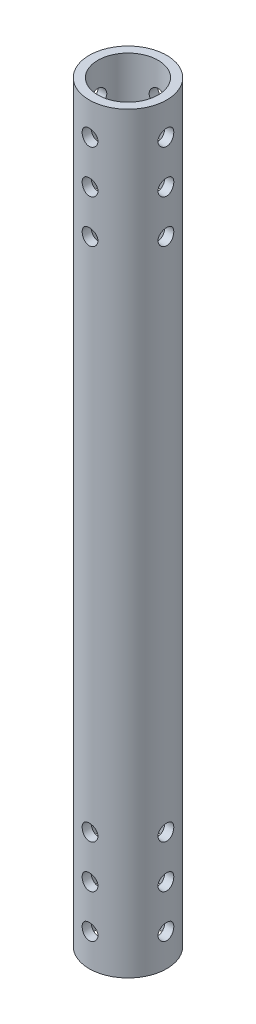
from build123d import *

# Parameters (mm, degrees)
SKETCH1_R                 = 54
SKETCH1_R_2               = 42
BOSS_EXTRUDE1_DEPTH       = 524.5
SKETCH2_R                 = 11
CUT_EXTRUDE1_DEPTH        = 100
CIRPATTERN1_COUNT         = 2
CIRPATTERN1_ANGLE         = 90
LPATTERN1_COUNT           = 3
LPATTERN1_PITCH           = 60
LPATTERN1_COPY_1_SKETCH_R = 11
LPATTERN1_COPY_1_DEPTH    = 100
LPATTERN1_COPY_2_SKETCH_R = 11
LPATTERN1_COPY_2_DEPTH    = 100
MIRROR1_COPY_1_SKETCH_R   = 11
MIRROR1_COPY_1_DEPTH      = 100
MIRROR1_COPY_2_SKETCH_R   = 11
MIRROR1_COPY_2_DEPTH      = 100
MIRROR1_COPY_3_SKETCH_R   = 11
MIRROR1_COPY_3_DEPTH      = 100
MIRROR1_COPY_4_SKETCH_R   = 11
MIRROR1_COPY_4_DEPTH      = 100
MIRROR1_COPY_5_SKETCH_R   = 11
MIRROR1_COPY_5_DEPTH      = 100


with BuildPart() as part:
    # Sketch1 → Boss-Extrude1 (new, symmetric)
    with BuildSketch(Plane(origin=(0, 0, 0), x_dir=(1, 0, 0), z_dir=(0, 1, 0))):
        with Locations(Location((0, 0, 0), (0, 0, 270))):
            Circle(SKETCH1_R)
        with Locations(Location((0, 0, 0), (0, 0, 270))):
            Circle(SKETCH1_R_2, mode=Mode.SUBTRACT)
    extrude(amount=BOSS_EXTRUDE1_DEPTH, both=True)

    # Sketch2 → Cut-Extrude1 (cut, symmetric)
    with BuildSketch(Plane.XY):
        with Locations((0, -479.5)):
            Circle(SKETCH2_R)
    cut_extrude1 = extrude(amount=CUT_EXTRUDE1_DEPTH, both=True, mode=Mode.SUBTRACT)

    # CirPattern1: Cut-Extrude1 ×2 about axis
    cirpattern1_axis = Axis((0, 524.5, 0), (0, -1, 0))
    for i in range(1, CIRPATTERN1_COUNT):
        add(cut_extrude1.rotate(cirpattern1_axis, i * CIRPATTERN1_ANGLE / (CIRPATTERN1_COUNT - 1)), mode=Mode.SUBTRACT)

    # LPattern1: Cut-Extrude1 ×3
    with Locations(*[(0, i * LPATTERN1_PITCH, 0) for i in range(1, LPATTERN1_COUNT)]):
        add(cut_extrude1, mode=Mode.SUBTRACT)

    # LPattern1 copy 1 sketch → LPattern1 copy 1 (cut, symmetric)
    with BuildSketch(Plane(origin=(0, 60, 0), x_dir=(0, 0, 1), z_dir=(-1, 0, 0))):
        with Locations((0, -479.5)):
            Circle(LPATTERN1_COPY_1_SKETCH_R)
    extrude(amount=LPATTERN1_COPY_1_DEPTH, both=True, mode=Mode.SUBTRACT)

    # LPattern1 copy 2 sketch → LPattern1 copy 2 (cut, symmetric)
    with BuildSketch(Plane(origin=(0, 120, 0), x_dir=(0, 0, 1), z_dir=(-1, 0, 0))):
        with Locations((0, -479.5)):
            Circle(LPATTERN1_COPY_2_SKETCH_R)
    extrude(amount=LPATTERN1_COPY_2_DEPTH, both=True, mode=Mode.SUBTRACT)

    # Mirror1: Cut-Extrude1 across plane
    add(cut_extrude1.mirror(Plane.ZX), mode=Mode.SUBTRACT)

    # Mirror1 copy 1 sketch → Mirror1 copy 1 (cut, symmetric)
    with BuildSketch(Plane.ZY):
        with Locations((0, 479.5)):
            Circle(MIRROR1_COPY_1_SKETCH_R)
    extrude(amount=MIRROR1_COPY_1_DEPTH, both=True, mode=Mode.SUBTRACT)

    # Mirror1 copy 2 sketch → Mirror1 copy 2 (cut, symmetric)
    with BuildSketch(Plane(origin=(0, -60, 0), x_dir=(1, 0, 0), z_dir=(0, 0, 1))):
        with Locations((0, 479.5)):
            Circle(MIRROR1_COPY_2_SKETCH_R)
    extrude(amount=MIRROR1_COPY_2_DEPTH, both=True, mode=Mode.SUBTRACT)

    # Mirror1 copy 3 sketch → Mirror1 copy 3 (cut, symmetric)
    with BuildSketch(Plane(origin=(0, -120, 0), x_dir=(1, 0, 0), z_dir=(0, 0, 1))):
        with Locations((0, 479.5)):
            Circle(MIRROR1_COPY_3_SKETCH_R)
    extrude(amount=MIRROR1_COPY_3_DEPTH, both=True, mode=Mode.SUBTRACT)

    # Mirror1 copy 4 sketch → Mirror1 copy 4 (cut, symmetric)
    with BuildSketch(Plane(origin=(0, -60, 0), x_dir=(0, 0, 1), z_dir=(-1, 0, 0))):
        with Locations((0, 479.5)):
            Circle(MIRROR1_COPY_4_SKETCH_R)
    extrude(amount=MIRROR1_COPY_4_DEPTH, both=True, mode=Mode.SUBTRACT)

    # Mirror1 copy 5 sketch → Mirror1 copy 5 (cut, symmetric)
    with BuildSketch(Plane(origin=(0, -120, 0), x_dir=(0, 0, 1), z_dir=(-1, 0, 0))):
        with Locations((0, 479.5)):
            Circle(MIRROR1_COPY_5_SKETCH_R)
    extrude(amount=MIRROR1_COPY_5_DEPTH, both=True, mode=Mode.SUBTRACT)


solid = part.part
